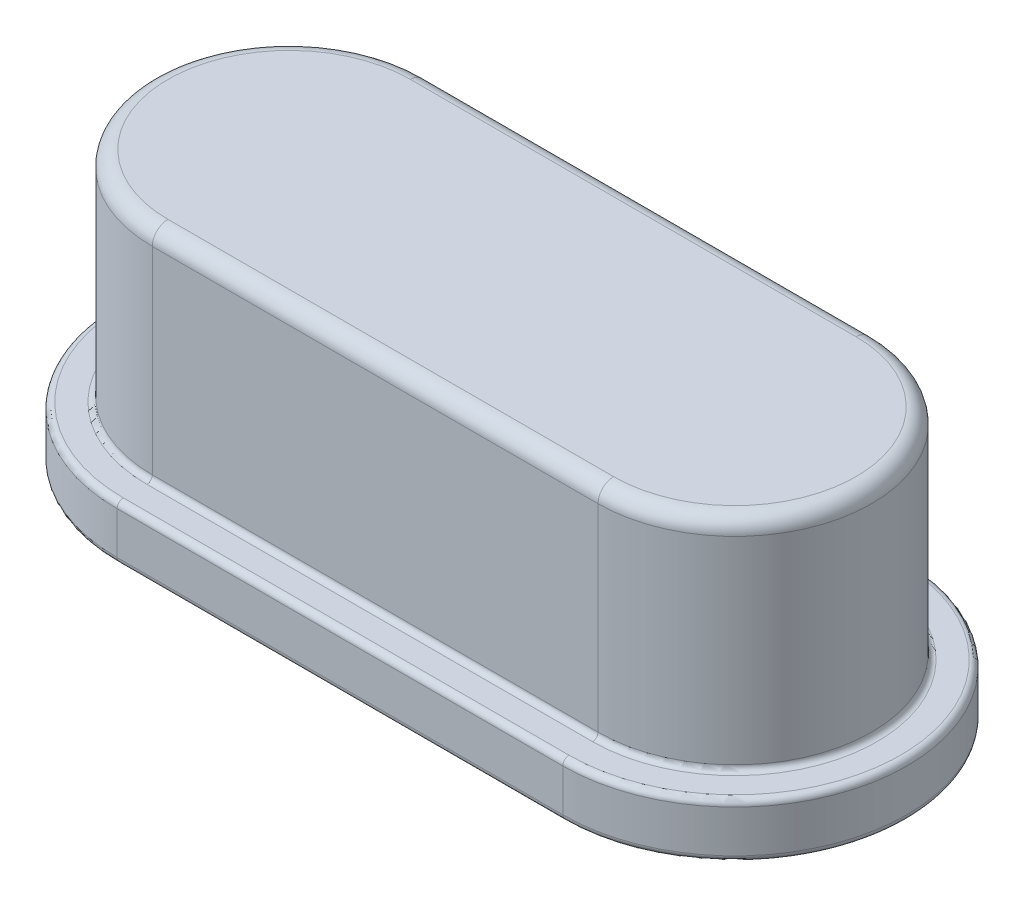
from build123d import *

# Parameters (mm, degrees)
BOSS_EXTRUDE1_DEPTH = 0.7
BOSS_EXTRUDE2_DEPTH = 2.8
FILLET1_R           = 0.2
FILLET2_R           = 0.08
FILLET3_R           = 0.07


with BuildPart() as part:
    # Sketch1 → Boss-Extrude1 (new body)
    with BuildSketch(Plane(origin=(0, 0, 0), x_dir=(1, 0, 0), z_dir=(0, 1, 0))):
        with BuildLine():
            Line((-2.85, 2.2), (2.85, 2.2))
            ThreePointArc((2.85, 2.2), (5.05, 0), (2.85, -2.2))
            Line((2.85, -2.2), (-2.85, -2.2))
            ThreePointArc((-2.85, -2.2), (-5.05, 0), (-2.85, 2.2))
        make_face()
    extrude(amount=BOSS_EXTRUDE1_DEPTH)

    # Sketch2 → Boss-Extrude2 (add)
    with BuildSketch(Plane(origin=(0, 0.7, 0), x_dir=(1, 0, 0), z_dir=(0, 1, 0))):
        with BuildLine():
            Line((-2.85, 1.75), (2.85, 1.75))
            ThreePointArc((2.85, 1.75), (4.6, 0), (2.85, -1.75))
            Line((2.85, -1.75), (-2.85, -1.75))
            ThreePointArc((-2.85, -1.75), (-4.6, 0), (-2.85, 1.75))
        make_face()
    extrude(amount=BOSS_EXTRUDE2_DEPTH)

    # Fillet1
    fillet1_edges = [part.edges().sort_by_distance(p)[0] for p in [
        (-4.6, 3.5, 0),
        (0, 3.5, 1.75),
        (4.6, 3.5, 0),
        (0, 3.5, -1.75),
    ]]
    fillet(fillet1_edges, radius=FILLET1_R)

    # Fillet2
    fillet2_edges = [part.edges().sort_by_distance(p)[0] for p in [
        (5.05, 0.7, 0),
        (0, 0.7, -2.2),
        (-5.05, 0.7, 0),
        (0, 0, -2.2),
        (5.05, 0, 0),
        (0, 0, 2.2),
        (-5.05, 0, 0),
        (0, 0.7, 2.2),
    ]]
    fillet(fillet2_edges, radius=FILLET2_R)

    # Fillet3
    fillet3_edges = [part.edges().sort_by_distance(p)[0] for p in [
        (-4.6, 0.7, 0),
        (0, 0.7, 1.75),
        (4.6, 0.7, 0),
        (0, 0.7, -1.75),
    ]]
    fillet(fillet3_edges, radius=FILLET3_R)


solid = part.part
